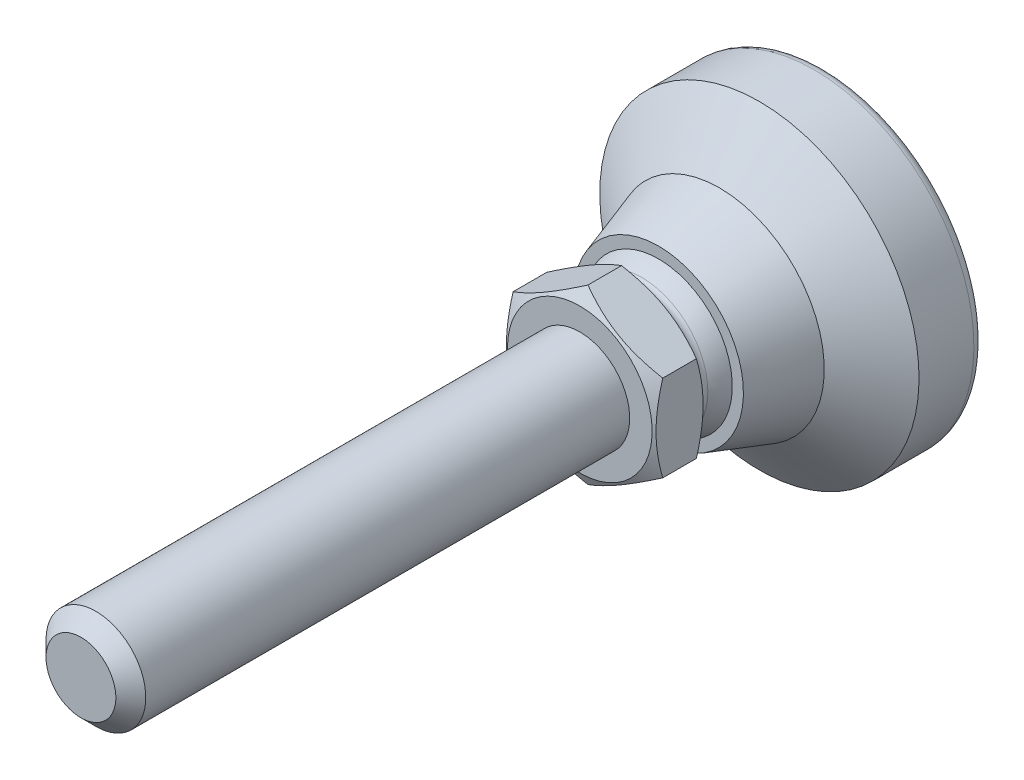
ISO-10303-21;
HEADER;
FILE_DESCRIPTION(('STEP AP214'),'2;1');
FILE_NAME('part.step','',(''),(''),'','','');
FILE_SCHEMA(('AUTOMOTIVE_DESIGN { 1 0 10303 214 1 1 1 1 }'));
ENDSEC;
DATA;
#1=APPLICATION_CONTEXT('core data for automotive mechanical design processes');
#2=APPLICATION_PROTOCOL_DEFINITION('international standard','automotive_design',2000,#1);
#3=PRODUCT_CONTEXT('',#1,'mechanical');
#4=PRODUCT('Part','Part','',(#3));
#5=PRODUCT_RELATED_PRODUCT_CATEGORY('part','',(#4));
#6=PRODUCT_DEFINITION_FORMATION('','',#4);
#7=PRODUCT_DEFINITION_CONTEXT('part definition',#1,'design');
#8=PRODUCT_DEFINITION('design','',#6,#7);
#9=PRODUCT_DEFINITION_SHAPE('','',#8);
#10=(LENGTH_UNIT() NAMED_UNIT(*) SI_UNIT(.MILLI.,.METRE.));
#11=(NAMED_UNIT(*) PLANE_ANGLE_UNIT() SI_UNIT($,.RADIAN.));
#12=(NAMED_UNIT(*) SI_UNIT($,.STERADIAN.) SOLID_ANGLE_UNIT());
#13=UNCERTAINTY_MEASURE_WITH_UNIT(LENGTH_MEASURE(1.E-05),#10,'distance_accuracy_value','');
#14=(GEOMETRIC_REPRESENTATION_CONTEXT(3) GLOBAL_UNCERTAINTY_ASSIGNED_CONTEXT((#13)) GLOBAL_UNIT_ASSIGNED_CONTEXT((#10,
#11,#12)) REPRESENTATION_CONTEXT('',''));
#15=CARTESIAN_POINT('',(0.,0.,0.));
#16=DIRECTION('',(0.,0.,1.));
#17=DIRECTION('',(1.,0.,0.));
#18=AXIS2_PLACEMENT_3D('',#15,#16,#17);
#19=CARTESIAN_POINT('',(0.,0.,18.7011230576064));
#20=DIRECTION('',(0.,0.,-1.));
#21=DIRECTION('',(0.,1.,0.));
#22=AXIS2_PLACEMENT_3D('',#19,#20,#21);
#23=TOROIDAL_SURFACE('',#22,7.30000010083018,0.799999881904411);
#24=CARTESIAN_POINT('',(0.,0.,19.5000000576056));
#25=DIRECTION('',(0.,0.,1.));
#26=DIRECTION('',(1.,0.,0.));
#27=AXIS2_PLACEMENT_3D('',#24,#25,#26);
#28=CIRCLE('',#27,7.25762853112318);
#29=CARTESIAN_POINT('',(7.25762853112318,0.,19.5000000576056));
#30=VERTEX_POINT('',#29);
#31=EDGE_CURVE('E264',#30,#30,#28,.F.);
#32=ORIENTED_EDGE('',*,*,#31,.T.);
#33=EDGE_LOOP('',(#32));
#34=FACE_BOUND('',#33,.T.);
#35=CARTESIAN_POINT('',(0.,0.,18.2846441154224));
#36=DIRECTION('',(0.,0.,-1.));
#37=DIRECTION('',(0.,1.,0.));
#38=AXIS2_PLACEMENT_3D('',#35,#36,#37);
#39=CIRCLE('',#38,6.61695903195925);
#40=CARTESIAN_POINT('',(-6.61695903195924,0.,18.2846441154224));
#41=VERTEX_POINT('',#40);
#42=EDGE_CURVE('E73',#41,#41,#39,.T.);
#43=ORIENTED_EDGE('',*,*,#42,.F.);
#44=EDGE_LOOP('',(#43));
#45=FACE_BOUND('',#44,.T.);
#46=ADVANCED_FACE('F14',(#34,#45),#23,.F.);
#47=CARTESIAN_POINT('',(0.,0.,14.249999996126));
#48=DIRECTION('',(0.,0.,-1.));
#49=DIRECTION('',(-1.,0.,0.));
#50=AXIS2_PLACEMENT_3D('',#47,#48,#49);
#51=SPHERICAL_SURFACE('',#50,7.75);
#52=CARTESIAN_POINT('',(0.,0.,16.6));
#53=DIRECTION('',(0.,0.,-1.));
#54=DIRECTION('',(0.,1.,0.));
#55=AXIS2_PLACEMENT_3D('',#52,#53,#54);
#56=CIRCLE('',#55,7.38512017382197);
#57=CARTESIAN_POINT('',(-7.38512017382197,0.,16.6));
#58=VERTEX_POINT('',#57);
#59=EDGE_CURVE('E120',#58,#58,#56,.T.);
#60=CARTESIAN_POINT('',(-7.38512017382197,0.,16.6));
#61=CARTESIAN_POINT('',(-7.37925798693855,0.,16.6184225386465));
#62=CARTESIAN_POINT('',(-7.37332686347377,0.,16.6368231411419));
#63=CARTESIAN_POINT('',(-7.36132708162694,0.,16.6735794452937));
#64=CARTESIAN_POINT('',(-7.3552584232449,0.,16.6919351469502));
#65=CARTESIAN_POINT('',(-7.34298390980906,0.,16.7286006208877));
#66=CARTESIAN_POINT('',(-7.33677805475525,0.,16.7469103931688));
#67=CARTESIAN_POINT('',(-7.32422949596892,0.,16.7834829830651));
#68=CARTESIAN_POINT('',(-7.3178867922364,0.,16.8017458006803));
#69=CARTESIAN_POINT('',(-7.30506489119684,0.,16.8382234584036));
#70=CARTESIAN_POINT('',(-7.29858569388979,0.,16.8564382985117));
#71=CARTESIAN_POINT('',(-7.28549116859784,0.,16.8928189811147));
#72=CARTESIAN_POINT('',(-7.27887584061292,0.,16.9109848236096));
#73=CARTESIAN_POINT('',(-7.26550942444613,0.,16.9472664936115));
#74=CARTESIAN_POINT('',(-7.25875833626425,0.,16.9653823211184));
#75=CARTESIAN_POINT('',(-7.24512077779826,0.,17.0015629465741));
#76=CARTESIAN_POINT('',(-7.23823430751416,0.,17.0196277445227));
#77=CARTESIAN_POINT('',(-7.22432637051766,0.,17.0557052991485));
#78=CARTESIAN_POINT('',(-7.21730490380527,0.,17.0737180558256));
#79=CARTESIAN_POINT('',(-7.2031273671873,0.,17.1096905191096));
#80=CARTESIAN_POINT('',(-7.19597129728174,0.,17.1276502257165));
#81=CARTESIAN_POINT('',(-7.18152495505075,0.,17.1635155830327));
#82=CARTESIAN_POINT('',(-7.17423468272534,0.,17.1814212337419));
#83=CARTESIAN_POINT('',(-7.159520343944,0.,17.2171774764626));
#84=CARTESIAN_POINT('',(-7.15209627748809,0.,17.235028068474));
#85=CARTESIAN_POINT('',(-7.13711476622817,0.,17.2706731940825));
#86=CARTESIAN_POINT('',(-7.12955732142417,0.,17.2884677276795));
#87=CARTESIAN_POINT('',(-7.11430947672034,0.,17.323999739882));
#88=CARTESIAN_POINT('',(-7.1066190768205,0.,17.3417372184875));
#89=CARTESIAN_POINT('',(-7.09110575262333,0.,17.3771541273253));
#90=CARTESIAN_POINT('',(-7.083282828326,0.,17.3948335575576));
#91=CARTESIAN_POINT('',(-7.06750489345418,0.,17.4301333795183));
#92=CARTESIAN_POINT('',(-7.05954988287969,0.,17.4477537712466));
#93=CARTESIAN_POINT('',(-7.04350822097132,0.,17.482934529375));
#94=CARTESIAN_POINT('',(-7.03542156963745,0.,17.5004948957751));
#95=CARTESIAN_POINT('',(-7.01911707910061,0.,17.5355546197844));
#96=CARTESIAN_POINT('',(-7.01089923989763,0.,17.5530539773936));
#97=CARTESIAN_POINT('',(-6.99433283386,0.,17.5879907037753));
#98=CARTESIAN_POINT('',(-6.98598426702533,0.,17.6054280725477));
#99=CARTESIAN_POINT('',(-6.96915687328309,0.,17.6402398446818));
#100=CARTESIAN_POINT('',(-6.96067804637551,0.,17.6576142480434));
#101=CARTESIAN_POINT('',(-6.94359060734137,0.,17.692299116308));
#102=CARTESIAN_POINT('',(-6.93498199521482,0.,17.7096095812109));
#103=CARTESIAN_POINT('',(-6.91763546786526,0.,17.7441656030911));
#104=CARTESIAN_POINT('',(-6.90889755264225,0.,17.7614111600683));
#105=CARTESIAN_POINT('',(-6.89129290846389,0.,17.7958364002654));
#106=CARTESIAN_POINT('',(-6.88242617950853,0.,17.8130160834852));
#107=CARTESIAN_POINT('',(-6.86456440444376,0.,17.8473086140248));
#108=CARTESIAN_POINT('',(-6.85556935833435,0.,17.8644214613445));
#109=CARTESIAN_POINT('',(-6.83745145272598,0.,17.8985793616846));
#110=CARTESIAN_POINT('',(-6.82832859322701,0.,17.9156244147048));
#111=CARTESIAN_POINT('',(-6.80995557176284,0.,17.9496457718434));
#112=CARTESIAN_POINT('',(-6.80070540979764,0.,17.9666220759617));
#113=CARTESIAN_POINT('',(-6.78207830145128,0.,18.0005049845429));
#114=CARTESIAN_POINT('',(-6.77270135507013,0.,18.0174115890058));
#115=CARTESIAN_POINT('',(-6.75382120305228,0.,18.0511541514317));
#116=CARTESIAN_POINT('',(-6.74431799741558,0.,18.0679901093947));
#117=CARTESIAN_POINT('',(-6.72518585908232,0.,18.1015904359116));
#118=CARTESIAN_POINT('',(-6.71555692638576,0.,18.1183548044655));
#119=CARTESIAN_POINT('',(-6.69617387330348,0.,18.1518110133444));
#120=CARTESIAN_POINT('',(-6.68641975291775,0.,18.1685028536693));
#121=CARTESIAN_POINT('',(-6.66678687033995,0.,18.2018130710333));
#122=CARTESIAN_POINT('',(-6.65690810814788,0.,18.2184314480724));
#123=CARTESIAN_POINT('',(-6.63702649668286,0.,18.2515938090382));
#124=CARTESIAN_POINT('',(-6.62702364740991,0.,18.2681377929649));
#125=CARTESIAN_POINT('',(-6.61695903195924,0.,18.2846441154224));
#126=B_SPLINE_CURVE_WITH_KNOTS('',3,(#60,#61,#62,#63,#64,#65,#66,#67,#68,#69,#70,#71,#72,#73,
#74,#75,#76,#77,#78,#79,#80,#81,#82,#83,#84,#85,#86,#87,#88,#89,#90,#91,#92,#93,#94,#95,#96,#97,
#98,#99,#100,#101,#102,#103,#104,#105,#106,#107,#108,#109,#110,#111,#112,#113,#114,#115,#116,
#117,#118,#119,#120,#121,#122,#123,#124,#125),.UNSPECIFIED.,.F.,.F.,(4,2,2,2,2,2,2,2,2,2,2,2,2,
2,2,2,2,2,2,2,2,2,2,2,2,2,2,2,2,2,2,2,4),(0.,0.0579981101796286,0.115996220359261,
0.173994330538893,0.231992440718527,0.289990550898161,0.347988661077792,0.405986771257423,
0.463984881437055,0.521982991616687,0.579981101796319,0.637979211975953,0.695977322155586,
0.753975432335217,0.811973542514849,0.86997165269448,0.927969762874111,0.985967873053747,
1.04396598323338,1.10196409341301,1.15996220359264,1.21796031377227,1.27595842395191,
1.33395653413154,1.39195464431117,1.4499527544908,1.50795086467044,1.56594897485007,
1.6239470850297,1.68194519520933,1.73994330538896,1.7979414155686,1.85593952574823),.UNSPECIFIED.);
#127=EDGE_CURVE('BSEAM241',#58,#41,#126,.T.);
#128=ORIENTED_EDGE('',*,*,#59,.F.);
#129=ORIENTED_EDGE('',*,*,#42,.T.);
#130=ORIENTED_EDGE('',*,*,#127,.T.);
#131=ORIENTED_EDGE('',*,*,#127,.F.);
#132=EDGE_LOOP('',(#128,#130,#129,#131));
#133=FACE_BOUND('',#132,.T.);
#134=ADVANCED_FACE('F241',(#133),#51,.T.);
#135=CARTESIAN_POINT('',(-7.38512017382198,0.,16.6));
#136=DIRECTION('',(0.,0.,-1.));
#137=DIRECTION('',(0.,1.,0.));
#138=AXIS2_PLACEMENT_3D('',#135,#136,#137);
#139=PLANE('',#138);
#140=CARTESIAN_POINT('',(0.,0.,16.6));
#141=DIRECTION('',(0.,0.,-1.));
#142=DIRECTION('',(0.,1.,0.));
#143=AXIS2_PLACEMENT_3D('',#140,#141,#142);
#144=CIRCLE('',#143,8.5);
#145=CARTESIAN_POINT('',(0.,8.5,16.6));
#146=VERTEX_POINT('',#145);
#147=EDGE_CURVE('E117',#146,#146,#144,.T.);
#148=ORIENTED_EDGE('',*,*,#147,.F.);
#149=EDGE_LOOP('',(#148));
#150=FACE_BOUND('',#149,.T.);
#151=ORIENTED_EDGE('',*,*,#59,.T.);
#152=EDGE_LOOP('',(#151));
#153=FACE_BOUND('',#152,.T.);
#154=ADVANCED_FACE('F247',(#150,#153),#139,.F.);
#155=CARTESIAN_POINT('',(0.,0.,16.6));
#156=DIRECTION('',(0.,0.,-1.));
#157=DIRECTION('',(0.,1.,0.));
#158=AXIS2_PLACEMENT_3D('',#155,#156,#157);
#159=CONICAL_SURFACE('',#158,8.5,0.316824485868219);
#160=CARTESIAN_POINT('',(0.,0.,10.5));
#161=DIRECTION('',(0.,0.,-1.));
#162=DIRECTION('',(0.,1.,0.));
#163=AXIS2_PLACEMENT_3D('',#160,#161,#162);
#164=CIRCLE('',#163,10.5);
#165=CARTESIAN_POINT('',(0.,10.5,10.5));
#166=VERTEX_POINT('',#165);
#167=EDGE_CURVE('E114',#166,#166,#164,.T.);
#168=ORIENTED_EDGE('',*,*,#167,.F.);
#169=EDGE_LOOP('',(#168));
#170=FACE_BOUND('',#169,.T.);
#171=ORIENTED_EDGE('',*,*,#147,.T.);
#172=EDGE_LOOP('',(#171));
#173=FACE_BOUND('',#172,.T.);
#174=ADVANCED_FACE('F290',(#170,#173),#159,.T.);
#175=CARTESIAN_POINT('',(0.,0.,10.5));
#176=DIRECTION('',(0.,0.,-1.));
#177=DIRECTION('',(0.,1.,0.));
#178=AXIS2_PLACEMENT_3D('',#175,#176,#177);
#179=CONICAL_SURFACE('',#178,10.5,0.942000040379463);
#180=CARTESIAN_POINT('',(0.,0.,6.5));
#181=DIRECTION('',(0.,0.,-1.));
#182=DIRECTION('',(0.,1.,0.));
#183=AXIS2_PLACEMENT_3D('',#180,#181,#182);
#184=CIRCLE('',#183,16.);
#185=CARTESIAN_POINT('',(0.,16.,6.5));
#186=VERTEX_POINT('',#185);
#187=EDGE_CURVE('E111',#186,#186,#184,.T.);
#188=ORIENTED_EDGE('',*,*,#187,.F.);
#189=EDGE_LOOP('',(#188));
#190=FACE_BOUND('',#189,.T.);
#191=ORIENTED_EDGE('',*,*,#167,.T.);
#192=EDGE_LOOP('',(#191));
#193=FACE_BOUND('',#192,.T.);
#194=ADVANCED_FACE('F286',(#190,#193),#179,.T.);
#195=CARTESIAN_POINT('',(0.,0.,0.));
#196=DIRECTION('',(0.,0.,-1.));
#197=DIRECTION('',(0.,1.,0.));
#198=AXIS2_PLACEMENT_3D('',#195,#196,#197);
#199=CYLINDRICAL_SURFACE('',#198,16.);
#200=CARTESIAN_POINT('',(0.,0.,1.));
#201=DIRECTION('',(0.,0.,-1.));
#202=DIRECTION('',(0.,1.,0.));
#203=AXIS2_PLACEMENT_3D('',#200,#201,#202);
#204=CIRCLE('',#203,16.);
#205=CARTESIAN_POINT('',(0.,16.,1.));
#206=VERTEX_POINT('',#205);
#207=EDGE_CURVE('E88',#206,#206,#204,.T.);
#208=ORIENTED_EDGE('',*,*,#207,.F.);
#209=EDGE_LOOP('',(#208));
#210=FACE_BOUND('',#209,.T.);
#211=ORIENTED_EDGE('',*,*,#187,.T.);
#212=EDGE_LOOP('',(#211));
#213=FACE_BOUND('',#212,.T.);
#214=ADVANCED_FACE('F280',(#210,#213),#199,.T.);
#215=CARTESIAN_POINT('',(0.,0.,1.));
#216=DIRECTION('',(0.,0.,-1.));
#217=DIRECTION('',(0.,1.,0.));
#218=AXIS2_PLACEMENT_3D('',#215,#216,#217);
#219=TOROIDAL_SURFACE('',#218,15.,1.);
#220=CARTESIAN_POINT('',(0.,0.,0.));
#221=DIRECTION('',(0.,0.,-1.));
#222=DIRECTION('',(0.,1.,0.));
#223=AXIS2_PLACEMENT_3D('',#220,#221,#222);
#224=CIRCLE('',#223,15.);
#225=CARTESIAN_POINT('',(0.,15.,0.));
#226=VERTEX_POINT('',#225);
#227=EDGE_CURVE('E85',#226,#226,#224,.T.);
#228=ORIENTED_EDGE('',*,*,#227,.F.);
#229=EDGE_LOOP('',(#228));
#230=FACE_BOUND('',#229,.T.);
#231=ORIENTED_EDGE('',*,*,#207,.T.);
#232=EDGE_LOOP('',(#231));
#233=FACE_BOUND('',#232,.T.);
#234=ADVANCED_FACE('F273',(#230,#233),#219,.T.);
#235=CARTESIAN_POINT('',(-15.,0.,0.));
#236=DIRECTION('',(0.,0.,1.));
#237=DIRECTION('',(0.,-1.,0.));
#238=AXIS2_PLACEMENT_3D('',#235,#236,#237);
#239=PLANE('',#238);
#240=ORIENTED_EDGE('',*,*,#227,.T.);
#241=EDGE_LOOP('',(#240));
#242=FACE_BOUND('',#241,.T.);
#243=ADVANCED_FACE('F268',(#242),#239,.F.);
#244=CARTESIAN_POINT('',(0.,7.25,19.5000000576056));
#245=DIRECTION('',(0.,0.,-1.));
#246=DIRECTION('',(-1.,0.,0.));
#247=AXIS2_PLACEMENT_3D('',#244,#245,#246);
#248=PLANE('',#247);
#249=CARTESIAN_POINT('',(0.,0.,19.5000000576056));
#250=DIRECTION('',(0.,0.,-1.));
#251=DIRECTION('',(-1.,0.,0.));
#252=AXIS2_PLACEMENT_3D('',#249,#250,#251);
#253=CIRCLE('',#252,7.25);
#254=CARTESIAN_POINT('',(-7.25,0.,19.5000000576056));
#255=VERTEX_POINT('',#254);
#256=EDGE_CURVE('E79',#255,#255,#253,.T.);
#257=ORIENTED_EDGE('',*,*,#256,.T.);
#258=EDGE_LOOP('',(#257));
#259=FACE_BOUND('',#258,.T.);
#260=ORIENTED_EDGE('',*,*,#31,.F.);
#261=EDGE_LOOP('',(#260));
#262=FACE_BOUND('',#261,.T.);
#263=ADVANCED_FACE('F139',(#259,#262),#248,.F.);
#264=CARTESIAN_POINT('',(0.,0.,21.3134150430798));
#265=DIRECTION('',(0.,0.,1.));
#266=DIRECTION('',(1.,0.,0.));
#267=AXIS2_PLACEMENT_3D('',#264,#265,#266);
#268=CONICAL_SURFACE('',#267,10.3909268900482,1.0471975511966);
#269=CARTESIAN_POINT('',(-7.5002,4.33001154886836,20.3142772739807));
#270=CARTESIAN_POINT('',(-7.3353416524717,4.42519256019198,20.2593328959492));
#271=CARTESIAN_POINT('',(-7.16986863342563,4.52072845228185,20.2068821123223));
#272=CARTESIAN_POINT('',(-6.83757877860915,4.71257608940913,20.1076545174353));
#273=CARTESIAN_POINT('',(-6.67076139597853,4.80888815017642,20.0608801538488));
#274=CARTESIAN_POINT('',(-6.16763831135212,5.09936639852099,19.9299898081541));
#275=CARTESIAN_POINT('',(-5.82934661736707,5.29467919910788,19.8555409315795));
#276=CARTESIAN_POINT('',(-5.32309925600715,5.58696124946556,19.7682409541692));
#277=CARTESIAN_POINT('',(-5.15665618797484,5.68305719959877,19.7433717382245));
#278=CARTESIAN_POINT('',(-4.82301799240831,5.87568330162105,19.701669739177));
#279=CARTESIAN_POINT('',(-4.65582293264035,5.97221341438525,19.6848362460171));
#280=CARTESIAN_POINT('',(-4.32114243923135,6.16544128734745,19.6596346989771));
#281=CARTESIAN_POINT('',(-4.15365755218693,6.26213873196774,19.6512570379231));
#282=CARTESIAN_POINT('',(-3.81854232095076,6.45561760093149,19.6431378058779));
#283=CARTESIAN_POINT('',(-3.65091198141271,6.55239902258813,19.6433959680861));
#284=CARTESIAN_POINT('',(-3.19166219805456,6.81754700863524,19.6559736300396));
#285=CARTESIAN_POINT('',(-2.90019309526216,6.98582677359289,19.6770872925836));
#286=CARTESIAN_POINT('',(-2.31919079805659,7.32126860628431,19.7440382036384));
#287=CARTESIAN_POINT('',(-2.02965964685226,7.48842949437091,19.7898983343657));
#288=CARTESIAN_POINT('',(-1.44748813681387,7.82454637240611,19.9045350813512));
#289=CARTESIAN_POINT('',(-1.15492123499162,7.99345995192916,19.9737973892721));
#290=CARTESIAN_POINT('',(-0.574150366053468,8.3287681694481,20.1309947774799));
#291=CARTESIAN_POINT('',(-0.285938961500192,8.49516710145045,20.2188929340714));
#292=CARTESIAN_POINT('',(0.00020000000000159,8.66036950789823,20.3142772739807));
#293=B_SPLINE_CURVE_WITH_KNOTS('',3,(#269,#270,#271,#272,#273,#274,#275,#276,#277,#278,#279,
#280,#281,#282,#283,#284,#285,#286,#287,#288,#289,#290,#291,#292),.UNSPECIFIED.,.F.,.F.,(4,2,2,
2,2,2,2,2,2,2,2,4),(0.,0.594350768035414,1.1889569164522,2.38063993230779,2.96188692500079,
3.54308254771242,4.12361709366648,4.70413370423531,5.71473675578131,6.72627588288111,
7.76024925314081,8.7921928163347),.UNSPECIFIED.);
#294=CARTESIAN_POINT('',(-7.5,4.3301270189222,20.3142106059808));
#295=VERTEX_POINT('',#294);
#296=CARTESIAN_POINT('',(0.,8.66025403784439,20.3142106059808));
#297=VERTEX_POINT('',#296);
#298=EDGE_CURVE('E29',#295,#297,#293,.T.);
#299=ORIENTED_EDGE('',*,*,#298,.T.);
#300=CARTESIAN_POINT('',(-0.000199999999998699,8.66036950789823,20.3142772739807));
#301=CARTESIAN_POINT('',(0.164658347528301,8.56518849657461,20.2593328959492));
#302=CARTESIAN_POINT('',(0.33013136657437,8.46965260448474,20.2068821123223));
#303=CARTESIAN_POINT('',(0.662421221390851,8.27780496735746,20.1076545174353));
#304=CARTESIAN_POINT('',(0.829238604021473,8.18149290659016,20.0608801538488));
#305=CARTESIAN_POINT('',(1.33236168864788,7.89101465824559,19.9299898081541));
#306=CARTESIAN_POINT('',(1.67065338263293,7.69570185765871,19.8555409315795));
#307=CARTESIAN_POINT('',(2.17690074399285,7.40341980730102,19.7682409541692));
#308=CARTESIAN_POINT('',(2.34334381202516,7.30732385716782,19.7433717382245));
#309=CARTESIAN_POINT('',(2.67698200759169,7.11469775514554,19.701669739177));
#310=CARTESIAN_POINT('',(2.84417706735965,7.01816764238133,19.6848362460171));
#311=CARTESIAN_POINT('',(3.17885756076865,6.82493976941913,19.6596346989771));
#312=CARTESIAN_POINT('',(3.34634244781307,6.72824232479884,19.6512570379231));
#313=CARTESIAN_POINT('',(3.68145767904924,6.53476345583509,19.6431378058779));
#314=CARTESIAN_POINT('',(3.8490880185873,6.43798203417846,19.6433959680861));
#315=CARTESIAN_POINT('',(4.30833780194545,6.17283404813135,19.6559736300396));
#316=CARTESIAN_POINT('',(4.59980690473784,6.0045542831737,19.6770872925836));
#317=CARTESIAN_POINT('',(5.18080920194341,5.66911245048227,19.7440382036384));
#318=CARTESIAN_POINT('',(5.47034035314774,5.50195156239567,19.7898983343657));
#319=CARTESIAN_POINT('',(6.05251186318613,5.16583468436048,19.9045350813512));
#320=CARTESIAN_POINT('',(6.34507876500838,4.99692110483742,19.9737973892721));
#321=CARTESIAN_POINT('',(6.92584963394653,4.66161288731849,20.1309947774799));
#322=CARTESIAN_POINT('',(7.21406103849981,4.49521395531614,20.2188929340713));
#323=CARTESIAN_POINT('',(7.5002,4.33001154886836,20.3142772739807));
#324=B_SPLINE_CURVE_WITH_KNOTS('',3,(#300,#301,#302,#303,#304,#305,#306,#307,#308,#309,#310,
#311,#312,#313,#314,#315,#316,#317,#318,#319,#320,#321,#322,#323),.UNSPECIFIED.,.F.,.F.,(4,2,2,
2,2,2,2,2,2,2,2,4),(0.,0.594350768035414,1.1889569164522,2.3806399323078,2.96188692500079,
3.54308254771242,4.12361709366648,4.70413370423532,5.71473675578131,6.72627588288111,
7.76024925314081,8.7921928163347),.UNSPECIFIED.);
#325=CARTESIAN_POINT('',(7.5,4.3301270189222,20.3142106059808));
#326=VERTEX_POINT('',#325);
#327=EDGE_CURVE('E66',#297,#326,#324,.T.);
#328=ORIENTED_EDGE('',*,*,#327,.T.);
#329=CARTESIAN_POINT('',(7.5,-11.6031313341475,23.2908986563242));
#330=CARTESIAN_POINT('',(7.5,-11.2757912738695,23.1322226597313));
#331=CARTESIAN_POINT('',(7.5,-10.9476967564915,22.9750762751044));
#332=CARTESIAN_POINT('',(7.5,-10.2895974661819,22.6647035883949));
#333=CARTESIAN_POINT('',(7.5,-9.95959239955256,22.5114779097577));
#334=CARTESIAN_POINT('',(7.5,-9.29555686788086,22.2090306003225));
#335=CARTESIAN_POINT('',(7.5,-8.96151425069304,22.0598355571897));
#336=CARTESIAN_POINT('',(7.5,-8.2907623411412,21.7675887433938));
#337=CARTESIAN_POINT('',(7.5,-7.95405317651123,21.6245366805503));
#338=CARTESIAN_POINT('',(7.5,-7.26667404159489,21.3417730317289));
#339=CARTESIAN_POINT('',(7.5,-6.91590042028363,21.2023120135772));
#340=CARTESIAN_POINT('',(7.5,-6.2102398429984,20.9340131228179));
#341=CARTESIAN_POINT('',(7.5,-5.85535242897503,20.8051764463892));
#342=CARTESIAN_POINT('',(7.5,-5.1415687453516,20.5615294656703));
#343=CARTESIAN_POINT('',(7.5,-4.78268235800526,20.4466905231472));
#344=CARTESIAN_POINT('',(7.5,-4.05977470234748,20.234740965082));
#345=CARTESIAN_POINT('',(7.5,-3.69575509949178,20.1376247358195));
#346=CARTESIAN_POINT('',(7.5,-2.96432817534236,19.9663211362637));
#347=CARTESIAN_POINT('',(7.5,-2.59695052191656,19.8920105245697));
#348=CARTESIAN_POINT('',(7.5,-2.04256118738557,19.8008801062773));
#349=CARTESIAN_POINT('',(7.5,-1.85719710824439,19.7738913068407));
#350=CARTESIAN_POINT('',(7.5,-1.4855571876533,19.7272222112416));
#351=CARTESIAN_POINT('',(7.5,-1.29928143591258,19.7075412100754));
#352=CARTESIAN_POINT('',(7.5,-0.928488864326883,19.6761251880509));
#353=CARTESIAN_POINT('',(7.5,-0.743980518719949,19.6642905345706));
#354=CARTESIAN_POINT('',(7.5,-0.374628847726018,19.6484323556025));
#355=CARTESIAN_POINT('',(7.5,-0.189785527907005,19.64440870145));
#356=CARTESIAN_POINT('',(7.5,0.179906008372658,19.6442684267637));
#357=CARTESIAN_POINT('',(7.5,0.364754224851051,19.6481518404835));
#358=CARTESIAN_POINT('',(7.5,0.734123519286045,19.6637312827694));
#359=CARTESIAN_POINT('',(7.5,0.918644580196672,19.6754277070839));
#360=CARTESIAN_POINT('',(7.5,1.36296023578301,19.7127523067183));
#361=CARTESIAN_POINT('',(7.5,1.62244599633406,19.7421349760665));
#362=CARTESIAN_POINT('',(7.5,2.13946089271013,19.8147415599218));
#363=CARTESIAN_POINT('',(7.5,2.39698975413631,19.857967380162));
#364=CARTESIAN_POINT('',(7.5,3.16636380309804,20.0061148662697));
#365=CARTESIAN_POINT('',(7.5,3.67470311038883,20.1294786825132));
#366=CARTESIAN_POINT('',(7.5,4.43476912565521,20.3430177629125));
#367=CARTESIAN_POINT('',(7.5,4.6904479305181,20.419931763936));
#368=CARTESIAN_POINT('',(7.5,5.19932153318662,20.58165257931));
#369=CARTESIAN_POINT('',(7.5,5.4525163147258,20.6664594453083));
#370=CARTESIAN_POINT('',(7.5,5.9565033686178,20.8426132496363));
#371=CARTESIAN_POINT('',(7.5,6.20729642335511,20.9339579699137));
#372=CARTESIAN_POINT('',(7.5,6.70681108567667,21.122122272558));
#373=CARTESIAN_POINT('',(7.5,6.95553271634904,21.2189417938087));
#374=CARTESIAN_POINT('',(7.5,7.53771967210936,21.4517718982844));
#375=CARTESIAN_POINT('',(7.5,7.87043383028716,21.5896571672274));
#376=CARTESIAN_POINT('',(7.5,8.53307427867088,21.8719901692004));
#377=CARTESIAN_POINT('',(7.5,8.86300040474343,22.0164382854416));
#378=CARTESIAN_POINT('',(7.5,9.52057128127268,22.3105924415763));
#379=CARTESIAN_POINT('',(7.5,9.84821557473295,22.4602995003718));
#380=CARTESIAN_POINT('',(7.5,10.5015480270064,22.7639302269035));
#381=CARTESIAN_POINT('',(7.5,10.8272361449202,22.9178539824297));
#382=CARTESIAN_POINT('',(7.5,11.4773047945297,23.2292929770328));
#383=CARTESIAN_POINT('',(7.5,11.8016836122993,23.3868117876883));
#384=CARTESIAN_POINT('',(7.5,12.4490521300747,23.7046810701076));
#385=CARTESIAN_POINT('',(7.5,12.7720418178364,23.8650315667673));
#386=CARTESIAN_POINT('',(7.5,13.7391730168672,24.3495428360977));
#387=CARTESIAN_POINT('',(7.5,14.3815607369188,24.6772039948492));
#388=CARTESIAN_POINT('',(7.5,15.6099638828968,25.3117519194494));
#389=CARTESIAN_POINT('',(7.5,16.1962499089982,25.6181171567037));
#390=CARTESIAN_POINT('',(7.5,17.3666390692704,26.2350342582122));
#391=CARTESIAN_POINT('',(7.5,17.9507421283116,26.5455862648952));
#392=CARTESIAN_POINT('',(7.5,19.1158224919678,27.1691239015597));
#393=CARTESIAN_POINT('',(7.5,19.696803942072,27.4821017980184));
#394=CARTESIAN_POINT('',(7.5,20.8573684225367,28.1105664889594));
#395=CARTESIAN_POINT('',(7.5,21.4369515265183,28.4260531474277));
#396=CARTESIAN_POINT('',(7.5,22.0160186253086,28.7424777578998));
#397=B_SPLINE_CURVE_WITH_KNOTS('',3,(#329,#330,#331,#332,#333,#334,#335,#336,#337,#338,#339,
#340,#341,#342,#343,#344,#345,#346,#347,#348,#349,#350,#351,#352,#353,#354,#355,#356,#357,#358,
#359,#360,#361,#362,#363,#364,#365,#366,#367,#368,#369,#370,#371,#372,#373,#374,#375,#376,#377,
#378,#379,#380,#381,#382,#383,#384,#385,#386,#387,#388,#389,#390,#391,#392,#393,#394,#395,#396),
.UNSPECIFIED.,.F.,.F.,(4,2,2,2,2,2,2,2,2,2,2,2,2,2,2,2,2,2,2,2,2,2,2,2,2,2,2,2,2,2,2,2,2,4),(0.,
1.09132747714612,2.18282742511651,3.28031725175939,4.37775482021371,5.51006272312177,
6.64249793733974,7.77257594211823,8.90229536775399,10.0257976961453,10.5876319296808,
11.14941194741,11.7039144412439,12.2584078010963,12.8129035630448,13.3674274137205,
14.1504164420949,14.933513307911,16.5005870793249,17.3015125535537,18.1024432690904,
18.9031035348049,19.7037548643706,20.7841230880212,21.8645544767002,22.9451963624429,
24.025860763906,25.1076500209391,26.1894487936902,28.3527662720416,30.3372679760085,
32.3218373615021,34.301591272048,36.2812385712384),.UNSPECIFIED.);
#398=CARTESIAN_POINT('',(7.5,-4.3301270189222,20.3142106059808));
#399=VERTEX_POINT('',#398);
#400=EDGE_CURVE('E69',#326,#399,#397,.F.);
#401=ORIENTED_EDGE('',*,*,#400,.T.);
#402=CARTESIAN_POINT('',(7.5002,-4.33001154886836,20.3142772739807));
#403=CARTESIAN_POINT('',(7.3353416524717,-4.42519256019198,20.2593328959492));
#404=CARTESIAN_POINT('',(7.16986863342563,-4.52072845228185,20.2068821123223));
#405=CARTESIAN_POINT('',(6.83757877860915,-4.71257608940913,20.1076545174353));
#406=CARTESIAN_POINT('',(6.67076139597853,-4.80888815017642,20.0608801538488));
#407=CARTESIAN_POINT('',(6.16763831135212,-5.09936639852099,19.9299898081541));
#408=CARTESIAN_POINT('',(5.82934661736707,-5.29467919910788,19.8555409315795));
#409=CARTESIAN_POINT('',(5.32309925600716,-5.58696124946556,19.7682409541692));
#410=CARTESIAN_POINT('',(5.15665618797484,-5.68305719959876,19.7433717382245));
#411=CARTESIAN_POINT('',(4.82301799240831,-5.87568330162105,19.701669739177));
#412=CARTESIAN_POINT('',(4.65582293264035,-5.97221341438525,19.6848362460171));
#413=CARTESIAN_POINT('',(4.32114243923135,-6.16544128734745,19.6596346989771));
#414=CARTESIAN_POINT('',(4.15365755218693,-6.26213873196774,19.6512570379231));
#415=CARTESIAN_POINT('',(3.81854232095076,-6.45561760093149,19.6431378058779));
#416=CARTESIAN_POINT('',(3.65091198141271,-6.55239902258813,19.6433959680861));
#417=CARTESIAN_POINT('',(3.19166219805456,-6.81754700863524,19.6559736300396));
#418=CARTESIAN_POINT('',(2.90019309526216,-6.98582677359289,19.6770872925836));
#419=CARTESIAN_POINT('',(2.31919079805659,-7.32126860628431,19.7440382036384));
#420=CARTESIAN_POINT('',(2.02965964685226,-7.48842949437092,19.7898983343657));
#421=CARTESIAN_POINT('',(1.44748813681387,-7.82454637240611,19.9045350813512));
#422=CARTESIAN_POINT('',(1.15492123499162,-7.99345995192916,19.9737973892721));
#423=CARTESIAN_POINT('',(0.574150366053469,-8.3287681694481,20.1309947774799));
#424=CARTESIAN_POINT('',(0.285938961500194,-8.49516710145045,20.2188929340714));
#425=CARTESIAN_POINT('',(-0.000200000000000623,-8.66036950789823,20.3142772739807));
#426=B_SPLINE_CURVE_WITH_KNOTS('',3,(#402,#403,#404,#405,#406,#407,#408,#409,#410,#411,#412,
#413,#414,#415,#416,#417,#418,#419,#420,#421,#422,#423,#424,#425),.UNSPECIFIED.,.F.,.F.,(4,2,2,
2,2,2,2,2,2,2,2,4),(0.,0.594350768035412,1.1889569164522,2.38063993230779,2.96188692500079,
3.54308254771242,4.12361709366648,4.70413370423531,5.71473675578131,6.72627588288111,
7.76024925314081,8.7921928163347),.UNSPECIFIED.);
#427=CARTESIAN_POINT('',(0.,-8.66025403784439,20.3142106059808));
#428=VERTEX_POINT('',#427);
#429=EDGE_CURVE('E78',#399,#428,#426,.T.);
#430=ORIENTED_EDGE('',*,*,#429,.T.);
#431=CARTESIAN_POINT('',(0.0002,-8.66036950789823,20.3142772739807));
#432=CARTESIAN_POINT('',(-0.164658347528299,-8.56518849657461,20.2593328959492));
#433=CARTESIAN_POINT('',(-0.330131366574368,-8.46965260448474,20.2068821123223));
#434=CARTESIAN_POINT('',(-0.662421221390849,-8.27780496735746,20.1076545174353));
#435=CARTESIAN_POINT('',(-0.829238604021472,-8.18149290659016,20.0608801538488));
#436=CARTESIAN_POINT('',(-1.33236168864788,-7.89101465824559,19.9299898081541));
#437=CARTESIAN_POINT('',(-1.67065338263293,-7.69570185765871,19.8555409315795));
#438=CARTESIAN_POINT('',(-2.17690074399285,-7.40341980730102,19.7682409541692));
#439=CARTESIAN_POINT('',(-2.34334381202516,-7.30732385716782,19.7433717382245));
#440=CARTESIAN_POINT('',(-2.67698200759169,-7.11469775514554,19.701669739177));
#441=CARTESIAN_POINT('',(-2.84417706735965,-7.01816764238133,19.6848362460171));
#442=CARTESIAN_POINT('',(-3.17885756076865,-6.82493976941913,19.6596346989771));
#443=CARTESIAN_POINT('',(-3.34634244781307,-6.72824232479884,19.6512570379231));
#444=CARTESIAN_POINT('',(-3.68145767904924,-6.53476345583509,19.6431378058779));
#445=CARTESIAN_POINT('',(-3.84908801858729,-6.43798203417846,19.6433959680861));
#446=CARTESIAN_POINT('',(-4.30833780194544,-6.17283404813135,19.6559736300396));
#447=CARTESIAN_POINT('',(-4.59980690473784,-6.0045542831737,19.6770872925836));
#448=CARTESIAN_POINT('',(-5.18080920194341,-5.66911245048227,19.7440382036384));
#449=CARTESIAN_POINT('',(-5.47034035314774,-5.50195156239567,19.7898983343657));
#450=CARTESIAN_POINT('',(-6.05251186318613,-5.16583468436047,19.9045350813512));
#451=CARTESIAN_POINT('',(-6.34507876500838,-4.99692110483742,19.9737973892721));
#452=CARTESIAN_POINT('',(-6.92584963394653,-4.66161288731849,20.1309947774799));
#453=CARTESIAN_POINT('',(-7.21406103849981,-4.49521395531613,20.2188929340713));
#454=CARTESIAN_POINT('',(-7.5002,-4.33001154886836,20.3142772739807));
#455=B_SPLINE_CURVE_WITH_KNOTS('',3,(#431,#432,#433,#434,#435,#436,#437,#438,#439,#440,#441,
#442,#443,#444,#445,#446,#447,#448,#449,#450,#451,#452,#453,#454),.UNSPECIFIED.,.F.,.F.,(4,2,2,
2,2,2,2,2,2,2,2,4),(0.,0.594350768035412,1.1889569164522,2.38063993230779,2.96188692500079,
3.54308254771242,4.12361709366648,4.70413370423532,5.71473675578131,6.72627588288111,
7.76024925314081,8.7921928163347),.UNSPECIFIED.);
#456=CARTESIAN_POINT('',(-7.5,-4.3301270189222,20.3142106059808));
#457=VERTEX_POINT('',#456);
#458=EDGE_CURVE('E161',#428,#457,#455,.T.);
#459=ORIENTED_EDGE('',*,*,#458,.T.);
#460=CARTESIAN_POINT('',(-7.5,-11.6031313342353,23.2908986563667));
#461=CARTESIAN_POINT('',(-7.5,-11.2757912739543,23.132222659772));
#462=CARTESIAN_POINT('',(-7.5,-10.9476967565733,22.9750762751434));
#463=CARTESIAN_POINT('',(-7.5,-10.2895974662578,22.6647035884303));
#464=CARTESIAN_POINT('',(-7.5,-9.95959239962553,22.5114779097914));
#465=CARTESIAN_POINT('',(-7.5,-9.29555686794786,22.2090306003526));
#466=CARTESIAN_POINT('',(-7.5,-8.96151425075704,22.059835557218));
#467=CARTESIAN_POINT('',(-7.5,-8.29076234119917,21.7675887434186));
#468=CARTESIAN_POINT('',(-7.5,-7.95405317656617,21.6245366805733));
#469=CARTESIAN_POINT('',(-7.5,-7.26667404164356,21.3417730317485));
#470=CARTESIAN_POINT('',(-7.5,-6.91590042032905,21.202312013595));
#471=CARTESIAN_POINT('',(-7.5,-6.21023984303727,20.9340131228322));
#472=CARTESIAN_POINT('',(-7.5,-5.8553524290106,20.8051764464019));
#473=CARTESIAN_POINT('',(-7.5,-5.14156874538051,20.5615294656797));
#474=CARTESIAN_POINT('',(-7.5,-4.78268235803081,20.4466905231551));
#475=CARTESIAN_POINT('',(-7.5,-4.05977470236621,20.2347409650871));
#476=CARTESIAN_POINT('',(-7.5,-3.69575509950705,20.1376247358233));
#477=CARTESIAN_POINT('',(-7.5,-2.96432817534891,19.966321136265));
#478=CARTESIAN_POINT('',(-7.5,-2.59695052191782,19.8920105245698));
#479=CARTESIAN_POINT('',(-7.5,-2.04256118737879,19.8008801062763));
#480=CARTESIAN_POINT('',(-7.5,-1.85719710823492,19.7738913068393));
#481=CARTESIAN_POINT('',(-7.5,-1.48555718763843,19.7272222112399));
#482=CARTESIAN_POINT('',(-7.5,-1.299281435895,19.7075412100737));
#483=CARTESIAN_POINT('',(-7.5,-0.928488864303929,19.6761251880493));
#484=CARTESIAN_POINT('',(-7.5,-0.743980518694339,19.6642905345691));
#485=CARTESIAN_POINT('',(-7.5,-0.374628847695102,19.6484323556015));
#486=CARTESIAN_POINT('',(-7.5,-0.189785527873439,19.6444087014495));
#487=CARTESIAN_POINT('',(-7.5,0.179906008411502,19.6442684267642));
#488=CARTESIAN_POINT('',(-7.5,0.364754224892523,19.6481518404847));
#489=CARTESIAN_POINT('',(-7.5,0.734123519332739,19.663731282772));
#490=CARTESIAN_POINT('',(-7.5,0.918644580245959,19.6754277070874));
#491=CARTESIAN_POINT('',(-7.5,1.36296023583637,19.7127523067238));
#492=CARTESIAN_POINT('',(-7.5,1.62244599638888,19.7421349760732));
#493=CARTESIAN_POINT('',(-7.5,2.13946089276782,19.814741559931));
#494=CARTESIAN_POINT('',(-7.5,2.3969897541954,19.8579673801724));
#495=CARTESIAN_POINT('',(-7.5,3.16636380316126,20.0061148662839));
#496=CARTESIAN_POINT('',(-7.5,3.6747031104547,20.1294786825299));
#497=CARTESIAN_POINT('',(-7.5,4.43476912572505,20.343017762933));
#498=CARTESIAN_POINT('',(-7.5,4.69044793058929,20.4199317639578));
#499=CARTESIAN_POINT('',(-7.5,5.19932153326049,20.5816525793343));
#500=CARTESIAN_POINT('',(-7.5,5.45251631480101,20.6664594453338));
#501=CARTESIAN_POINT('',(-7.5,5.95650336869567,20.8426132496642));
#502=CARTESIAN_POINT('',(-7.5,6.2072964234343,20.9339579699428));
#503=CARTESIAN_POINT('',(-7.5,6.70681108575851,21.1221222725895));
#504=CARTESIAN_POINT('',(-7.5,6.9555327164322,21.2189417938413));
#505=CARTESIAN_POINT('',(-7.5,7.53771967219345,21.4517718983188));
#506=CARTESIAN_POINT('',(-7.5,7.87043383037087,21.5896571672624));
#507=CARTESIAN_POINT('',(-7.5,8.53307427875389,21.8719901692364));
#508=CARTESIAN_POINT('',(-7.5,8.8630004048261,22.016438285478));
#509=CARTESIAN_POINT('',(-7.5,9.52057128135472,22.3105924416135));
#510=CARTESIAN_POINT('',(-7.5,9.84821557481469,22.4602995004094));
#511=CARTESIAN_POINT('',(-7.5,10.5015480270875,22.7639302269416));
#512=CARTESIAN_POINT('',(-7.5,10.8272361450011,22.9178539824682));
#513=CARTESIAN_POINT('',(-7.5,11.4773047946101,23.2292929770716));
#514=CARTESIAN_POINT('',(-7.5,11.8016836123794,23.3868117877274));
#515=CARTESIAN_POINT('',(-7.5,12.4490521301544,23.704681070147));
#516=CARTESIAN_POINT('',(-7.5,12.7720418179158,23.8650315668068));
#517=CARTESIAN_POINT('',(-7.5,13.7391730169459,24.3495428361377));
#518=CARTESIAN_POINT('',(-7.5,14.3815607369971,24.6772039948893));
#519=CARTESIAN_POINT('',(-7.5,15.6099638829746,25.31175191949));
#520=CARTESIAN_POINT('',(-7.5,16.196249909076,25.6181171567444));
#521=CARTESIAN_POINT('',(-7.5,17.3666390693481,26.2350342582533));
#522=CARTESIAN_POINT('',(-7.5,17.9507421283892,26.5455862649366));
#523=CARTESIAN_POINT('',(-7.5,19.1158224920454,27.1691239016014));
#524=CARTESIAN_POINT('',(-7.5,19.6968039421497,27.4821017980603));
#525=CARTESIAN_POINT('',(-7.5,20.8573684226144,28.1105664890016));
#526=CARTESIAN_POINT('',(-7.5,21.4369515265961,28.4260531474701));
#527=CARTESIAN_POINT('',(-7.5,22.0160186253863,28.7424777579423));
#528=B_SPLINE_CURVE_WITH_KNOTS('',3,(#460,#461,#462,#463,#464,#465,#466,#467,#468,#469,#470,
#471,#472,#473,#474,#475,#476,#477,#478,#479,#480,#481,#482,#483,#484,#485,#486,#487,#488,#489,
#490,#491,#492,#493,#494,#495,#496,#497,#498,#499,#500,#501,#502,#503,#504,#505,#506,#507,#508,
#509,#510,#511,#512,#513,#514,#515,#516,#517,#518,#519,#520,#521,#522,#523,#524,#525,#526,#527),
.UNSPECIFIED.,.F.,.F.,(4,2,2,2,2,2,2,2,2,2,2,2,2,2,2,2,2,2,2,2,2,2,2,2,2,2,2,2,2,2,2,2,2,4),(0.,
1.0913274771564,2.18282742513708,3.28031725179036,4.37775482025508,5.51006272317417,
6.64249793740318,7.77257594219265,8.90229536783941,10.0257976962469,10.5876319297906,
11.1494119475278,11.7039144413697,12.25840780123,12.8129035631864,13.36742741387,
14.1504164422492,14.9335133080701,16.5005870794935,17.3015125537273,18.102443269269,
18.9031035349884,19.7037548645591,20.7841230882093,21.8645544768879,22.9451963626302,
24.0258607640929,25.1076500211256,26.1894487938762,28.3527662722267,30.3372679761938,
32.3218373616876,34.3015912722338,36.2812385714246),.UNSPECIFIED.);
#529=EDGE_CURVE('E168',#457,#295,#528,.T.);
#530=ORIENTED_EDGE('',*,*,#529,.T.);
#531=EDGE_LOOP('',(#299,#328,#401,#430,#459,#530));
#532=FACE_BOUND('',#531,.T.);
#533=ORIENTED_EDGE('',*,*,#256,.F.);
#534=EDGE_LOOP('',(#533));
#535=FACE_BOUND('',#534,.T.);
#536=ADVANCED_FACE('F67',(#532,#535),#268,.T.);
#537=CARTESIAN_POINT('',(-5.00000010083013,0.,24.5000000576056));
#538=DIRECTION('',(0.,0.,-1.));
#539=DIRECTION('',(0.,1.,0.));
#540=AXIS2_PLACEMENT_3D('',#537,#538,#539);
#541=PLANE('',#540);
#542=CARTESIAN_POINT('',(0.,0.,24.5000000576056));
#543=DIRECTION('',(0.,0.,-1.));
#544=DIRECTION('',(-1.,0.,0.));
#545=AXIS2_PLACEMENT_3D('',#542,#543,#544);
#546=CIRCLE('',#545,5.);
#547=CARTESIAN_POINT('',(-5.,0.,24.5000000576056));
#548=VERTEX_POINT('',#547);
#549=EDGE_CURVE('E131',#548,#548,#546,.T.);
#550=ORIENTED_EDGE('',*,*,#549,.T.);
#551=EDGE_LOOP('',(#550));
#552=FACE_BOUND('',#551,.T.);
#553=CARTESIAN_POINT('',(0.,0.,24.5000000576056));
#554=DIRECTION('',(0.,0.,-1.));
#555=DIRECTION('',(-1.,0.,0.));
#556=AXIS2_PLACEMENT_3D('',#553,#554,#555);
#557=CIRCLE('',#556,7.25);
#558=CARTESIAN_POINT('',(-7.25,0.,24.5000000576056));
#559=VERTEX_POINT('',#558);
#560=EDGE_CURVE('E262',#559,#559,#557,.T.);
#561=ORIENTED_EDGE('',*,*,#560,.F.);
#562=EDGE_LOOP('',(#561));
#563=FACE_BOUND('',#562,.T.);
#564=ADVANCED_FACE('F138',(#552,#563),#541,.F.);
#565=CARTESIAN_POINT('',(0.,0.,24.5000000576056));
#566=DIRECTION('',(0.,0.,-1.));
#567=DIRECTION('',(-1.,0.,0.));
#568=AXIS2_PLACEMENT_3D('',#565,#566,#567);
#569=CONICAL_SURFACE('',#568,7.25,1.0471975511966);
#570=CARTESIAN_POINT('',(0.000200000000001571,8.66036950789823,23.6857228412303));
#571=CARTESIAN_POINT('',(-0.1646583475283,8.56518849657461,23.7406672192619));
#572=CARTESIAN_POINT('',(-0.33013136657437,8.46965260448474,23.7931180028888));
#573=CARTESIAN_POINT('',(-0.662421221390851,8.27780496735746,23.8923455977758));
#574=CARTESIAN_POINT('',(-0.829238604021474,8.18149290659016,23.9391199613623));
#575=CARTESIAN_POINT('',(-1.33236168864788,7.89101465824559,24.070010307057));
#576=CARTESIAN_POINT('',(-1.67065338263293,7.69570185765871,24.1444591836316));
#577=CARTESIAN_POINT('',(-2.17690074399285,7.40341980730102,24.2317591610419));
#578=CARTESIAN_POINT('',(-2.34334381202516,7.30732385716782,24.2566283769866));
#579=CARTESIAN_POINT('',(-2.67698200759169,7.11469775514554,24.2983303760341));
#580=CARTESIAN_POINT('',(-2.84417706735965,7.01816764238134,24.315163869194));
#581=CARTESIAN_POINT('',(-3.17885756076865,6.82493976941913,24.340365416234));
#582=CARTESIAN_POINT('',(-3.34634244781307,6.72824232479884,24.348743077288));
#583=CARTESIAN_POINT('',(-3.68145767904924,6.5347634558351,24.3568623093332));
#584=CARTESIAN_POINT('',(-3.84908801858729,6.43798203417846,24.356604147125));
#585=CARTESIAN_POINT('',(-4.30833780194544,6.17283404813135,24.3440264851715));
#586=CARTESIAN_POINT('',(-4.59980690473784,6.0045542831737,24.3229128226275));
#587=CARTESIAN_POINT('',(-5.18080920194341,5.66911245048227,24.2559619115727));
#588=CARTESIAN_POINT('',(-5.47034035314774,5.50195156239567,24.2101017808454));
#589=CARTESIAN_POINT('',(-6.05251186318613,5.16583468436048,24.0954650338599));
#590=CARTESIAN_POINT('',(-6.34507876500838,4.99692110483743,24.026202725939));
#591=CARTESIAN_POINT('',(-6.92584963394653,4.66161288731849,23.8690053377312));
#592=CARTESIAN_POINT('',(-7.21406103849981,4.49521395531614,23.7811071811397));
#593=CARTESIAN_POINT('',(-7.5002,4.33001154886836,23.6857228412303));
#594=B_SPLINE_CURVE_WITH_KNOTS('',3,(#570,#571,#572,#573,#574,#575,#576,#577,#578,#579,#580,
#581,#582,#583,#584,#585,#586,#587,#588,#589,#590,#591,#592,#593),.UNSPECIFIED.,.F.,.F.,(4,2,2,
2,2,2,2,2,2,2,2,4),(0.,0.594350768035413,1.1889569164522,2.38063993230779,2.96188692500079,
3.54308254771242,4.12361709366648,4.70413370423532,5.71473675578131,6.72627588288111,
7.76024925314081,8.7921928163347),.UNSPECIFIED.);
#595=CARTESIAN_POINT('',(0.,8.66025403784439,23.6857895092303));
#596=VERTEX_POINT('',#595);
#597=CARTESIAN_POINT('',(-7.5,4.3301270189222,23.6857895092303));
#598=VERTEX_POINT('',#597);
#599=EDGE_CURVE('E93',#596,#598,#594,.T.);
#600=ORIENTED_EDGE('',*,*,#599,.T.);
#601=CARTESIAN_POINT('',(-7.5,-11.6031313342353,20.7091014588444));
#602=CARTESIAN_POINT('',(-7.5,-11.2757912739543,20.8677774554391));
#603=CARTESIAN_POINT('',(-7.5,-10.9476967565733,21.0249238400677));
#604=CARTESIAN_POINT('',(-7.5,-10.2895974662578,21.3352965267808));
#605=CARTESIAN_POINT('',(-7.5,-9.95959239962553,21.4885222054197));
#606=CARTESIAN_POINT('',(-7.5,-9.29555686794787,21.7909695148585));
#607=CARTESIAN_POINT('',(-7.5,-8.96151425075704,21.9401645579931));
#608=CARTESIAN_POINT('',(-7.5,-8.29076234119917,22.2324113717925));
#609=CARTESIAN_POINT('',(-7.5,-7.95405317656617,22.3754634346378));
#610=CARTESIAN_POINT('',(-7.5,-7.26667404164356,22.6582270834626));
#611=CARTESIAN_POINT('',(-7.5,-6.91590042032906,22.7976881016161));
#612=CARTESIAN_POINT('',(-7.5,-6.21023984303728,23.0659869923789));
#613=CARTESIAN_POINT('',(-7.5,-5.8553524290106,23.1948236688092));
#614=CARTESIAN_POINT('',(-7.5,-5.14156874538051,23.4384706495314));
#615=CARTESIAN_POINT('',(-7.5,-4.78268235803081,23.553309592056));
#616=CARTESIAN_POINT('',(-7.5,-4.05977470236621,23.765259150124));
#617=CARTESIAN_POINT('',(-7.5,-3.69575509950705,23.8623753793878));
#618=CARTESIAN_POINT('',(-7.5,-2.96432817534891,24.0336789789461));
#619=CARTESIAN_POINT('',(-7.5,-2.59695052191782,24.1079895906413));
#620=CARTESIAN_POINT('',(-7.5,-2.04256118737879,24.1991200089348));
#621=CARTESIAN_POINT('',(-7.5,-1.85719710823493,24.2261088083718));
#622=CARTESIAN_POINT('',(-7.5,-1.48555718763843,24.2727779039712));
#623=CARTESIAN_POINT('',(-7.5,-1.299281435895,24.2924589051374));
#624=CARTESIAN_POINT('',(-7.5,-0.928488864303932,24.3238749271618));
#625=CARTESIAN_POINT('',(-7.5,-0.743980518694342,24.335709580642));
#626=CARTESIAN_POINT('',(-7.5,-0.374628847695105,24.3515677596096));
#627=CARTESIAN_POINT('',(-7.5,-0.189785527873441,24.3555914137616));
#628=CARTESIAN_POINT('',(-7.5,0.179906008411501,24.3557316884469));
#629=CARTESIAN_POINT('',(-7.5,0.364754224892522,24.3518482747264));
#630=CARTESIAN_POINT('',(-7.5,0.734123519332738,24.3362688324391));
#631=CARTESIAN_POINT('',(-7.5,0.918644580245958,24.3245724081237));
#632=CARTESIAN_POINT('',(-7.5,1.36296023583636,24.2872478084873));
#633=CARTESIAN_POINT('',(-7.5,1.62244599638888,24.2578651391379));
#634=CARTESIAN_POINT('',(-7.5,2.13946089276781,24.1852585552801));
#635=CARTESIAN_POINT('',(-7.5,2.3969897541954,24.1420327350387));
#636=CARTESIAN_POINT('',(-7.5,3.16636380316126,23.9938852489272));
#637=CARTESIAN_POINT('',(-7.5,3.67470311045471,23.8705214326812));
#638=CARTESIAN_POINT('',(-7.5,4.43476912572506,23.6569823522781));
#639=CARTESIAN_POINT('',(-7.5,4.6904479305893,23.5800683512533));
#640=CARTESIAN_POINT('',(-7.5,5.19932153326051,23.4183475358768));
#641=CARTESIAN_POINT('',(-7.5,5.45251631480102,23.3335406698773));
#642=CARTESIAN_POINT('',(-7.5,5.95650336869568,23.1573868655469));
#643=CARTESIAN_POINT('',(-7.5,6.20729642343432,23.0660421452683));
#644=CARTESIAN_POINT('',(-7.5,6.70681108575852,22.8778778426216));
#645=CARTESIAN_POINT('',(-7.5,6.95553271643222,22.7810583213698));
#646=CARTESIAN_POINT('',(-7.5,7.53771967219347,22.5482282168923));
#647=CARTESIAN_POINT('',(-7.5,7.87043383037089,22.4103429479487));
#648=CARTESIAN_POINT('',(-7.5,8.5330742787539,22.1280099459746));
#649=CARTESIAN_POINT('',(-7.5,8.86300040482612,21.9835618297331));
#650=CARTESIAN_POINT('',(-7.5,9.52057128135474,21.6894076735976));
#651=CARTESIAN_POINT('',(-7.5,9.84821557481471,21.5397006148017));
#652=CARTESIAN_POINT('',(-7.5,10.5015480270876,21.2360698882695));
#653=CARTESIAN_POINT('',(-7.5,10.8272361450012,21.0821461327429));
#654=CARTESIAN_POINT('',(-7.5,11.4773047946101,20.7707071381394));
#655=CARTESIAN_POINT('',(-7.5,11.8016836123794,20.6131883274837));
#656=CARTESIAN_POINT('',(-7.5,12.4490521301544,20.295319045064));
#657=CARTESIAN_POINT('',(-7.5,12.7720418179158,20.1349685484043));
#658=CARTESIAN_POINT('',(-7.5,13.7391730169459,19.6504572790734));
#659=CARTESIAN_POINT('',(-7.5,14.3815607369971,19.3227961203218));
#660=CARTESIAN_POINT('',(-7.5,15.6099638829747,18.6882481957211));
#661=CARTESIAN_POINT('',(-7.5,16.196249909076,18.3818829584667));
#662=CARTESIAN_POINT('',(-7.5,17.3666390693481,17.7649658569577));
#663=CARTESIAN_POINT('',(-7.5,17.9507421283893,17.4544138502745));
#664=CARTESIAN_POINT('',(-7.5,19.1158224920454,16.8308762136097));
#665=CARTESIAN_POINT('',(-7.5,19.6968039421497,16.5178983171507));
#666=CARTESIAN_POINT('',(-7.5,20.8573684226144,15.8894336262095));
#667=CARTESIAN_POINT('',(-7.5,21.4369515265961,15.573946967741));
#668=CARTESIAN_POINT('',(-7.5,22.0160186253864,15.2575223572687));
#669=B_SPLINE_CURVE_WITH_KNOTS('',3,(#601,#602,#603,#604,#605,#606,#607,#608,#609,#610,#611,
#612,#613,#614,#615,#616,#617,#618,#619,#620,#621,#622,#623,#624,#625,#626,#627,#628,#629,#630,
#631,#632,#633,#634,#635,#636,#637,#638,#639,#640,#641,#642,#643,#644,#645,#646,#647,#648,#649,
#650,#651,#652,#653,#654,#655,#656,#657,#658,#659,#660,#661,#662,#663,#664,#665,#666,#667,#668),
.UNSPECIFIED.,.F.,.F.,(4,2,2,2,2,2,2,2,2,2,2,2,2,2,2,2,2,2,2,2,2,2,2,2,2,2,2,2,2,2,2,2,2,4),(0.,
1.0913274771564,2.18282742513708,3.28031725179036,4.37775482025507,5.51006272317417,
6.64249793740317,7.77257594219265,8.9022953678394,10.0257976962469,10.5876319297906,
11.1494119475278,11.7039144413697,12.25840780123,12.8129035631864,13.36742741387,
14.1504164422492,14.9335133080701,16.5005870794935,17.3015125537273,18.102443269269,
18.9031035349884,19.7037548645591,20.7841230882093,21.8645544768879,22.9451963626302,
24.0258607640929,25.1076500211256,26.1894487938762,28.3527662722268,30.3372679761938,
32.3218373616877,34.3015912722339,36.2812385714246),.UNSPECIFIED.);
#670=CARTESIAN_POINT('',(-7.5,-4.3301270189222,23.6857895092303));
#671=VERTEX_POINT('',#670);
#672=EDGE_CURVE('E188',#598,#671,#669,.F.);
#673=ORIENTED_EDGE('',*,*,#672,.T.);
#674=CARTESIAN_POINT('',(-7.5002,-4.33001154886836,23.6857228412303));
#675=CARTESIAN_POINT('',(-7.3353416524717,-4.42519256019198,23.7406672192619));
#676=CARTESIAN_POINT('',(-7.16986863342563,-4.52072845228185,23.7931180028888));
#677=CARTESIAN_POINT('',(-6.83757877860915,-4.71257608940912,23.8923455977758));
#678=CARTESIAN_POINT('',(-6.67076139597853,-4.80888815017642,23.9391199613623));
#679=CARTESIAN_POINT('',(-6.16763831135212,-5.09936639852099,24.070010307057));
#680=CARTESIAN_POINT('',(-5.82934661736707,-5.29467919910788,24.1444591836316));
#681=CARTESIAN_POINT('',(-5.32309925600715,-5.58696124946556,24.2317591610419));
#682=CARTESIAN_POINT('',(-5.15665618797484,-5.68305719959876,24.2566283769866));
#683=CARTESIAN_POINT('',(-4.82301799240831,-5.87568330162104,24.2983303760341));
#684=CARTESIAN_POINT('',(-4.65582293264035,-5.97221341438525,24.315163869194));
#685=CARTESIAN_POINT('',(-4.32114243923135,-6.16544128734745,24.340365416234));
#686=CARTESIAN_POINT('',(-4.15365755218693,-6.26213873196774,24.348743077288));
#687=CARTESIAN_POINT('',(-3.81854232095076,-6.45561760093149,24.3568623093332));
#688=CARTESIAN_POINT('',(-3.65091198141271,-6.55239902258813,24.356604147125));
#689=CARTESIAN_POINT('',(-3.19166219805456,-6.81754700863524,24.3440264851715));
#690=CARTESIAN_POINT('',(-2.90019309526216,-6.98582677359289,24.3229128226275));
#691=CARTESIAN_POINT('',(-2.31919079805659,-7.32126860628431,24.2559619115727));
#692=CARTESIAN_POINT('',(-2.02965964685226,-7.48842949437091,24.2101017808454));
#693=CARTESIAN_POINT('',(-1.44748813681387,-7.82454637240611,24.0954650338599));
#694=CARTESIAN_POINT('',(-1.15492123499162,-7.99345995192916,24.026202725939));
#695=CARTESIAN_POINT('',(-0.574150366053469,-8.32876816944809,23.8690053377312));
#696=CARTESIAN_POINT('',(-0.285938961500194,-8.49516710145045,23.7811071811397));
#697=CARTESIAN_POINT('',(0.000199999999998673,-8.66036950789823,23.6857228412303));
#698=B_SPLINE_CURVE_WITH_KNOTS('',3,(#674,#675,#676,#677,#678,#679,#680,#681,#682,#683,#684,
#685,#686,#687,#688,#689,#690,#691,#692,#693,#694,#695,#696,#697),.UNSPECIFIED.,.F.,.F.,(4,2,2,
2,2,2,2,2,2,2,2,4),(0.,0.594350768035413,1.1889569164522,2.38063993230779,2.96188692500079,
3.54308254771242,4.12361709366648,4.70413370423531,5.71473675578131,6.72627588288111,
7.7602492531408,8.7921928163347),.UNSPECIFIED.);
#699=CARTESIAN_POINT('',(0.,-8.66025403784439,23.6857895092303));
#700=VERTEX_POINT('',#699);
#701=EDGE_CURVE('E195',#671,#700,#698,.T.);
#702=ORIENTED_EDGE('',*,*,#701,.T.);
#703=CARTESIAN_POINT('',(-0.000200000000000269,-8.66036950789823,23.6857228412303));
#704=CARTESIAN_POINT('',(0.1646583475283,-8.56518849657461,23.7406672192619));
#705=CARTESIAN_POINT('',(0.33013136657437,-8.46965260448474,23.7931180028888));
#706=CARTESIAN_POINT('',(0.662421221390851,-8.27780496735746,23.8923455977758));
#707=CARTESIAN_POINT('',(0.829238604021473,-8.18149290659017,23.9391199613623));
#708=CARTESIAN_POINT('',(1.33236168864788,-7.8910146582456,24.070010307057));
#709=CARTESIAN_POINT('',(1.67065338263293,-7.69570185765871,24.1444591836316));
#710=CARTESIAN_POINT('',(2.17690074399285,-7.40341980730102,24.2317591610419));
#711=CARTESIAN_POINT('',(2.34334381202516,-7.30732385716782,24.2566283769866));
#712=CARTESIAN_POINT('',(2.67698200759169,-7.11469775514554,24.2983303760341));
#713=CARTESIAN_POINT('',(2.84417706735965,-7.01816764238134,24.315163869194));
#714=CARTESIAN_POINT('',(3.17885756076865,-6.82493976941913,24.340365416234));
#715=CARTESIAN_POINT('',(3.34634244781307,-6.72824232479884,24.348743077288));
#716=CARTESIAN_POINT('',(3.68145767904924,-6.5347634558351,24.3568623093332));
#717=CARTESIAN_POINT('',(3.84908801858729,-6.43798203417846,24.356604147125));
#718=CARTESIAN_POINT('',(4.30833780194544,-6.17283404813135,24.3440264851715));
#719=CARTESIAN_POINT('',(4.59980690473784,-6.0045542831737,24.3229128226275));
#720=CARTESIAN_POINT('',(5.18080920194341,-5.66911245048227,24.2559619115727));
#721=CARTESIAN_POINT('',(5.47034035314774,-5.50195156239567,24.2101017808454));
#722=CARTESIAN_POINT('',(6.05251186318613,-5.16583468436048,24.0954650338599));
#723=CARTESIAN_POINT('',(6.34507876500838,-4.99692110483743,24.026202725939));
#724=CARTESIAN_POINT('',(6.92584963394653,-4.66161288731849,23.8690053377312));
#725=CARTESIAN_POINT('',(7.21406103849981,-4.49521395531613,23.7811071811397));
#726=CARTESIAN_POINT('',(7.5002,-4.33001154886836,23.6857228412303));
#727=B_SPLINE_CURVE_WITH_KNOTS('',3,(#703,#704,#705,#706,#707,#708,#709,#710,#711,#712,#713,
#714,#715,#716,#717,#718,#719,#720,#721,#722,#723,#724,#725,#726),.UNSPECIFIED.,.F.,.F.,(4,2,2,
2,2,2,2,2,2,2,2,4),(0.,0.594350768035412,1.1889569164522,2.38063993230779,2.96188692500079,
3.54308254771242,4.12361709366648,4.70413370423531,5.71473675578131,6.72627588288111,
7.76024925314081,8.7921928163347),.UNSPECIFIED.);
#728=CARTESIAN_POINT('',(7.5,-4.3301270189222,23.6857895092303));
#729=VERTEX_POINT('',#728);
#730=EDGE_CURVE('E223',#700,#729,#727,.T.);
#731=ORIENTED_EDGE('',*,*,#730,.T.);
#732=CARTESIAN_POINT('',(7.5,-11.6031313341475,20.7091014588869));
#733=CARTESIAN_POINT('',(7.5,-11.2757912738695,20.8677774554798));
#734=CARTESIAN_POINT('',(7.5,-10.9476967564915,21.0249238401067));
#735=CARTESIAN_POINT('',(7.5,-10.2895974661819,21.3352965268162));
#736=CARTESIAN_POINT('',(7.5,-9.95959239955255,21.4885222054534));
#737=CARTESIAN_POINT('',(7.5,-9.29555686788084,21.7909695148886));
#738=CARTESIAN_POINT('',(7.5,-8.96151425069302,21.9401645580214));
#739=CARTESIAN_POINT('',(7.5,-8.29076234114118,22.2324113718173));
#740=CARTESIAN_POINT('',(7.5,-7.95405317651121,22.3754634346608));
#741=CARTESIAN_POINT('',(7.5,-7.26667404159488,22.6582270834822));
#742=CARTESIAN_POINT('',(7.5,-6.91590042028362,22.7976881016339));
#743=CARTESIAN_POINT('',(7.5,-6.21023984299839,23.0659869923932));
#744=CARTESIAN_POINT('',(7.5,-5.85535242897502,23.1948236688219));
#745=CARTESIAN_POINT('',(7.5,-5.14156874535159,23.4384706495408));
#746=CARTESIAN_POINT('',(7.5,-4.78268235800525,23.5533095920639));
#747=CARTESIAN_POINT('',(7.5,-4.05977470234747,23.7652591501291));
#748=CARTESIAN_POINT('',(7.5,-3.69575509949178,23.8623753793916));
#749=CARTESIAN_POINT('',(7.5,-2.96432817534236,24.0336789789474));
#750=CARTESIAN_POINT('',(7.5,-2.59695052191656,24.1079895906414));
#751=CARTESIAN_POINT('',(7.5,-2.04256118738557,24.1991200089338));
#752=CARTESIAN_POINT('',(7.5,-1.85719710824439,24.2261088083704));
#753=CARTESIAN_POINT('',(7.5,-1.4855571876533,24.2727779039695));
#754=CARTESIAN_POINT('',(7.5,-1.29928143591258,24.2924589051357));
#755=CARTESIAN_POINT('',(7.5,-0.928488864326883,24.3238749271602));
#756=CARTESIAN_POINT('',(7.5,-0.743980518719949,24.3357095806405));
#757=CARTESIAN_POINT('',(7.5,-0.374628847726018,24.3515677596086));
#758=CARTESIAN_POINT('',(7.5,-0.189785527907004,24.3555914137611));
#759=CARTESIAN_POINT('',(7.5,0.17990600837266,24.3557316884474));
#760=CARTESIAN_POINT('',(7.5,0.364754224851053,24.3518482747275));
#761=CARTESIAN_POINT('',(7.5,0.734123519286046,24.3362688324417));
#762=CARTESIAN_POINT('',(7.5,0.918644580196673,24.3245724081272));
#763=CARTESIAN_POINT('',(7.5,1.36296023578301,24.2872478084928));
#764=CARTESIAN_POINT('',(7.5,1.62244599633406,24.2578651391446));
#765=CARTESIAN_POINT('',(7.5,2.13946089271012,24.1852585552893));
#766=CARTESIAN_POINT('',(7.5,2.3969897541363,24.1420327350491));
#767=CARTESIAN_POINT('',(7.5,3.16636380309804,23.9938852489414));
#768=CARTESIAN_POINT('',(7.5,3.67470311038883,23.8705214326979));
#769=CARTESIAN_POINT('',(7.5,4.43476912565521,23.6569823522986));
#770=CARTESIAN_POINT('',(7.5,4.6904479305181,23.5800683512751));
#771=CARTESIAN_POINT('',(7.5,5.19932153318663,23.4183475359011));
#772=CARTESIAN_POINT('',(7.5,5.45251631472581,23.3335406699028));
#773=CARTESIAN_POINT('',(7.5,5.95650336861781,23.1573868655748));
#774=CARTESIAN_POINT('',(7.5,6.20729642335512,23.0660421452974));
#775=CARTESIAN_POINT('',(7.5,6.70681108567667,22.8778778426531));
#776=CARTESIAN_POINT('',(7.5,6.95553271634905,22.7810583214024));
#777=CARTESIAN_POINT('',(7.5,7.53771967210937,22.5482282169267));
#778=CARTESIAN_POINT('',(7.5,7.87043383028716,22.4103429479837));
#779=CARTESIAN_POINT('',(7.5,8.53307427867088,22.1280099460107));
#780=CARTESIAN_POINT('',(7.5,8.86300040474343,21.9835618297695));
#781=CARTESIAN_POINT('',(7.5,9.52057128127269,21.6894076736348));
#782=CARTESIAN_POINT('',(7.5,9.84821557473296,21.5397006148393));
#783=CARTESIAN_POINT('',(7.5,10.5015480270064,21.2360698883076));
#784=CARTESIAN_POINT('',(7.5,10.8272361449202,21.0821461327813));
#785=CARTESIAN_POINT('',(7.5,11.4773047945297,20.7707071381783));
#786=CARTESIAN_POINT('',(7.5,11.8016836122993,20.6131883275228));
#787=CARTESIAN_POINT('',(7.5,12.4490521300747,20.2953190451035));
#788=CARTESIAN_POINT('',(7.5,12.7720418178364,20.1349685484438));
#789=CARTESIAN_POINT('',(7.5,13.7391730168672,19.6504572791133));
#790=CARTESIAN_POINT('',(7.5,14.3815607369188,19.3227961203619));
#791=CARTESIAN_POINT('',(7.5,15.6099638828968,18.6882481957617));
#792=CARTESIAN_POINT('',(7.5,16.1962499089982,18.3818829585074));
#793=CARTESIAN_POINT('',(7.5,17.3666390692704,17.7649658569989));
#794=CARTESIAN_POINT('',(7.5,17.9507421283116,17.4544138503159));
#795=CARTESIAN_POINT('',(7.5,19.1158224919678,16.8308762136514));
#796=CARTESIAN_POINT('',(7.5,19.696803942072,16.5178983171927));
#797=CARTESIAN_POINT('',(7.5,20.8573684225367,15.8894336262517));
#798=CARTESIAN_POINT('',(7.5,21.4369515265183,15.5739469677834));
#799=CARTESIAN_POINT('',(7.5,22.0160186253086,15.2575223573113));
#800=B_SPLINE_CURVE_WITH_KNOTS('',3,(#732,#733,#734,#735,#736,#737,#738,#739,#740,#741,#742,
#743,#744,#745,#746,#747,#748,#749,#750,#751,#752,#753,#754,#755,#756,#757,#758,#759,#760,#761,
#762,#763,#764,#765,#766,#767,#768,#769,#770,#771,#772,#773,#774,#775,#776,#777,#778,#779,#780,
#781,#782,#783,#784,#785,#786,#787,#788,#789,#790,#791,#792,#793,#794,#795,#796,#797,#798,#799),
.UNSPECIFIED.,.F.,.F.,(4,2,2,2,2,2,2,2,2,2,2,2,2,2,2,2,2,2,2,2,2,2,2,2,2,2,2,2,2,2,2,2,2,4),(0.,
1.09132747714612,2.18282742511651,3.28031725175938,4.3777548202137,5.51006272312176,
6.64249793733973,7.77257594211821,8.90229536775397,10.0257976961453,10.5876319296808,
11.14941194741,11.7039144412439,12.2584078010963,12.8129035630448,13.3674274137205,
14.1504164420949,14.933513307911,16.5005870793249,17.3015125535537,18.1024432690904,
18.9031035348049,19.7037548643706,20.7841230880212,21.8645544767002,22.9451963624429,
24.025860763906,25.1076500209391,26.1894487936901,28.3527662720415,30.3372679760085,
32.3218373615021,34.301591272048,36.2812385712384),.UNSPECIFIED.);
#801=CARTESIAN_POINT('',(7.5,4.3301270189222,23.6857895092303));
#802=VERTEX_POINT('',#801);
#803=EDGE_CURVE('E217',#729,#802,#800,.T.);
#804=ORIENTED_EDGE('',*,*,#803,.T.);
#805=CARTESIAN_POINT('',(7.5002,4.33001154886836,23.6857228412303));
#806=CARTESIAN_POINT('',(7.3353416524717,4.42519256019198,23.7406672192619));
#807=CARTESIAN_POINT('',(7.16986863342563,4.52072845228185,23.7931180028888));
#808=CARTESIAN_POINT('',(6.83757877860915,4.71257608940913,23.8923455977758));
#809=CARTESIAN_POINT('',(6.67076139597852,4.80888815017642,23.9391199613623));
#810=CARTESIAN_POINT('',(6.16763831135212,5.09936639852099,24.070010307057));
#811=CARTESIAN_POINT('',(5.82934661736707,5.29467919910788,24.1444591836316));
#812=CARTESIAN_POINT('',(5.32309925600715,5.58696124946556,24.2317591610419));
#813=CARTESIAN_POINT('',(5.15665618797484,5.68305719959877,24.2566283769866));
#814=CARTESIAN_POINT('',(4.8230179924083,5.87568330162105,24.2983303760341));
#815=CARTESIAN_POINT('',(4.65582293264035,5.97221341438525,24.315163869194));
#816=CARTESIAN_POINT('',(4.32114243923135,6.16544128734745,24.340365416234));
#817=CARTESIAN_POINT('',(4.15365755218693,6.26213873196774,24.348743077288));
#818=CARTESIAN_POINT('',(3.81854232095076,6.45561760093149,24.3568623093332));
#819=CARTESIAN_POINT('',(3.65091198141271,6.55239902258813,24.356604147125));
#820=CARTESIAN_POINT('',(3.19166219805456,6.81754700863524,24.3440264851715));
#821=CARTESIAN_POINT('',(2.90019309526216,6.98582677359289,24.3229128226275));
#822=CARTESIAN_POINT('',(2.31919079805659,7.32126860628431,24.2559619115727));
#823=CARTESIAN_POINT('',(2.02965964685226,7.48842949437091,24.2101017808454));
#824=CARTESIAN_POINT('',(1.44748813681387,7.82454637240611,24.0954650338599));
#825=CARTESIAN_POINT('',(1.15492123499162,7.99345995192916,24.026202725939));
#826=CARTESIAN_POINT('',(0.574150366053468,8.32876816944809,23.8690053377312));
#827=CARTESIAN_POINT('',(0.285938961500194,8.49516710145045,23.7811071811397));
#828=CARTESIAN_POINT('',(-0.000199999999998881,8.66036950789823,23.6857228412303));
#829=B_SPLINE_CURVE_WITH_KNOTS('',3,(#805,#806,#807,#808,#809,#810,#811,#812,#813,#814,#815,
#816,#817,#818,#819,#820,#821,#822,#823,#824,#825,#826,#827,#828),.UNSPECIFIED.,.F.,.F.,(4,2,2,
2,2,2,2,2,2,2,2,4),(0.,0.594350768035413,1.1889569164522,2.38063993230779,2.96188692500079,
3.54308254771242,4.12361709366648,4.70413370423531,5.71473675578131,6.72627588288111,
7.7602492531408,8.7921928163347),.UNSPECIFIED.);
#830=EDGE_CURVE('E84',#802,#596,#829,.T.);
#831=ORIENTED_EDGE('',*,*,#830,.T.);
#832=EDGE_LOOP('',(#600,#673,#702,#731,#804,#831));
#833=FACE_BOUND('',#832,.T.);
#834=ORIENTED_EDGE('',*,*,#560,.T.);
#835=EDGE_LOOP('',(#834));
#836=FACE_BOUND('',#835,.T.);
#837=ADVANCED_FACE('F201',(#833,#836),#569,.T.);
#838=CARTESIAN_POINT('',(7.5,4.3301270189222,-34.3652621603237));
#839=DIRECTION('',(0.5,0.866025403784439,0.));
#840=DIRECTION('',(-0.866025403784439,0.5,0.));
#841=AXIS2_PLACEMENT_3D('',#838,#839,#840);
#842=PLANE('',#841);
#843=ORIENTED_EDGE('',*,*,#327,.F.);
#844=DIRECTION('',(0.,0.,1.));
#845=VECTOR('',#844,1.);
#846=CARTESIAN_POINT('',(0.,8.66025403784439,-34.3652621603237));
#847=LINE('',#846,#845);
#848=EDGE_CURVE('E107',#297,#596,#847,.T.);
#849=ORIENTED_EDGE('',*,*,#848,.T.);
#850=ORIENTED_EDGE('',*,*,#830,.F.);
#851=DIRECTION('',(0.,0.,1.));
#852=VECTOR('',#851,1.);
#853=CARTESIAN_POINT('',(7.5,4.3301270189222,-34.3652621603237));
#854=LINE('',#853,#852);
#855=EDGE_CURVE('E37',#326,#802,#854,.T.);
#856=ORIENTED_EDGE('',*,*,#855,.F.);
#857=EDGE_LOOP('',(#843,#849,#850,#856));
#858=FACE_BOUND('',#857,.T.);
#859=ADVANCED_FACE('F82',(#858),#842,.T.);
#860=CARTESIAN_POINT('',(7.5,-4.3301270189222,-34.3652621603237));
#861=DIRECTION('',(1.,0.,0.));
#862=DIRECTION('',(0.,0.,-1.));
#863=AXIS2_PLACEMENT_3D('',#860,#861,#862);
#864=PLANE('',#863);
#865=ORIENTED_EDGE('',*,*,#400,.F.);
#866=ORIENTED_EDGE('',*,*,#855,.T.);
#867=ORIENTED_EDGE('',*,*,#803,.F.);
#868=DIRECTION('',(0.,0.,1.));
#869=VECTOR('',#868,1.);
#870=CARTESIAN_POINT('',(7.5,-4.3301270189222,-34.3652621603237));
#871=LINE('',#870,#869);
#872=EDGE_CURVE('E77',#399,#729,#871,.T.);
#873=ORIENTED_EDGE('',*,*,#872,.F.);
#874=EDGE_LOOP('',(#865,#866,#867,#873));
#875=FACE_BOUND('',#874,.T.);
#876=ADVANCED_FACE('F76',(#875),#864,.T.);
#877=CARTESIAN_POINT('',(0.,-8.66025403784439,-34.3652621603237));
#878=DIRECTION('',(0.5,-0.866025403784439,0.));
#879=DIRECTION('',(0.866025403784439,0.5,0.));
#880=AXIS2_PLACEMENT_3D('',#877,#878,#879);
#881=PLANE('',#880);
#882=ORIENTED_EDGE('',*,*,#429,.F.);
#883=ORIENTED_EDGE('',*,*,#872,.T.);
#884=ORIENTED_EDGE('',*,*,#730,.F.);
#885=DIRECTION('',(0.,0.,1.));
#886=VECTOR('',#885,1.);
#887=CARTESIAN_POINT('',(0.,-8.66025403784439,-34.3652621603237));
#888=LINE('',#887,#886);
#889=EDGE_CURVE('E90',#428,#700,#888,.T.);
#890=ORIENTED_EDGE('',*,*,#889,.F.);
#891=EDGE_LOOP('',(#882,#883,#884,#890));
#892=FACE_BOUND('',#891,.T.);
#893=ADVANCED_FACE('F229',(#892),#881,.T.);
#894=CARTESIAN_POINT('',(-7.5,-4.3301270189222,-34.3652621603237));
#895=DIRECTION('',(-0.5,-0.866025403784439,0.));
#896=DIRECTION('',(0.866025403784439,-0.5,0.));
#897=AXIS2_PLACEMENT_3D('',#894,#895,#896);
#898=PLANE('',#897);
#899=ORIENTED_EDGE('',*,*,#458,.F.);
#900=ORIENTED_EDGE('',*,*,#889,.T.);
#901=ORIENTED_EDGE('',*,*,#701,.F.);
#902=DIRECTION('',(0.,0.,1.));
#903=VECTOR('',#902,1.);
#904=CARTESIAN_POINT('',(-7.5,-4.3301270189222,-34.3652621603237));
#905=LINE('',#904,#903);
#906=EDGE_CURVE('E103',#457,#671,#905,.T.);
#907=ORIENTED_EDGE('',*,*,#906,.F.);
#908=EDGE_LOOP('',(#899,#900,#901,#907));
#909=FACE_BOUND('',#908,.T.);
#910=ADVANCED_FACE('F183',(#909),#898,.T.);
#911=CARTESIAN_POINT('',(-7.5,4.3301270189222,-34.3652621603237));
#912=DIRECTION('',(-1.,0.,0.));
#913=DIRECTION('',(0.,-1.,0.));
#914=AXIS2_PLACEMENT_3D('',#911,#912,#913);
#915=PLANE('',#914);
#916=ORIENTED_EDGE('',*,*,#529,.F.);
#917=ORIENTED_EDGE('',*,*,#906,.T.);
#918=ORIENTED_EDGE('',*,*,#672,.F.);
#919=DIRECTION('',(0.,0.,1.));
#920=VECTOR('',#919,1.);
#921=CARTESIAN_POINT('',(-7.5,4.3301270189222,-34.3652621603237));
#922=LINE('',#921,#920);
#923=EDGE_CURVE('E105',#295,#598,#922,.T.);
#924=ORIENTED_EDGE('',*,*,#923,.F.);
#925=EDGE_LOOP('',(#916,#917,#918,#924));
#926=FACE_BOUND('',#925,.T.);
#927=ADVANCED_FACE('F179',(#926),#915,.T.);
#928=CARTESIAN_POINT('',(0.,8.66025403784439,-34.3652621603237));
#929=DIRECTION('',(-0.5,0.866025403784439,0.));
#930=DIRECTION('',(-0.866025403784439,-0.5,0.));
#931=AXIS2_PLACEMENT_3D('',#928,#929,#930);
#932=PLANE('',#931);
#933=ORIENTED_EDGE('',*,*,#298,.F.);
#934=ORIENTED_EDGE('',*,*,#923,.T.);
#935=ORIENTED_EDGE('',*,*,#599,.F.);
#936=ORIENTED_EDGE('',*,*,#848,.F.);
#937=EDGE_LOOP('',(#933,#934,#935,#936));
#938=FACE_BOUND('',#937,.T.);
#939=ADVANCED_FACE('F182',(#938),#932,.T.);
#940=CARTESIAN_POINT('',(0.,0.,74.5));
#941=DIRECTION('',(0.,0.,-1.));
#942=DIRECTION('',(-1.,0.,0.));
#943=AXIS2_PLACEMENT_3D('',#940,#941,#942);
#944=CYLINDRICAL_SURFACE('',#943,5.);
#945=CARTESIAN_POINT('',(0.,0.,73.));
#946=DIRECTION('',(0.,0.,-1.));
#947=DIRECTION('',(-1.,0.,0.));
#948=AXIS2_PLACEMENT_3D('',#945,#946,#947);
#949=CIRCLE('',#948,5.);
#950=CARTESIAN_POINT('',(-5.,0.,73.));
#951=VERTEX_POINT('',#950);
#952=EDGE_CURVE('E22',#951,#951,#949,.T.);
#953=ORIENTED_EDGE('',*,*,#952,.T.);
#954=EDGE_LOOP('',(#953));
#955=FACE_BOUND('',#954,.T.);
#956=ORIENTED_EDGE('',*,*,#549,.F.);
#957=EDGE_LOOP('',(#956));
#958=FACE_BOUND('',#957,.T.);
#959=ADVANCED_FACE('F140',(#955,#958),#944,.T.);
#960=CARTESIAN_POINT('',(0.,0.,74.5));
#961=DIRECTION('',(0.,0.,-1.));
#962=DIRECTION('',(-1.,0.,0.));
#963=AXIS2_PLACEMENT_3D('',#960,#961,#962);
#964=PLANE('',#963);
#965=CARTESIAN_POINT('',(0.,0.,74.5));
#966=DIRECTION('',(0.,0.,-1.));
#967=DIRECTION('',(-1.,0.,0.));
#968=AXIS2_PLACEMENT_3D('',#965,#966,#967);
#969=CIRCLE('',#968,3.5);
#970=CARTESIAN_POINT('',(-3.5,0.,74.5));
#971=VERTEX_POINT('',#970);
#972=EDGE_CURVE('E9',#971,#971,#969,.F.);
#973=ORIENTED_EDGE('',*,*,#972,.T.);
#974=EDGE_LOOP('',(#973));
#975=FACE_BOUND('',#974,.T.);
#976=ADVANCED_FACE('F404',(#975),#964,.F.);
#977=CARTESIAN_POINT('',(0.,0.,73.));
#978=DIRECTION('',(0.,0.,-1.));
#979=DIRECTION('',(-1.,0.,0.));
#980=AXIS2_PLACEMENT_3D('',#977,#978,#979);
#981=CONICAL_SURFACE('',#980,5.,0.785398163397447);
#982=ORIENTED_EDGE('',*,*,#972,.F.);
#983=EDGE_LOOP('',(#982));
#984=FACE_BOUND('',#983,.T.);
#985=ORIENTED_EDGE('',*,*,#952,.F.);
#986=EDGE_LOOP('',(#985));
#987=FACE_BOUND('',#986,.T.);
#988=ADVANCED_FACE('F16',(#984,#987),#981,.T.);
#989=CLOSED_SHELL('',(#46,#134,#154,#174,#194,#214,#234,#243,#263,#536,#564,#837,#859,#876,#893,
#910,#927,#939,#959,#976,#988));
#990=MANIFOLD_SOLID_BREP('B1',#989);
#991=ADVANCED_BREP_SHAPE_REPRESENTATION('',(#18,#990),#14);
#992=SHAPE_DEFINITION_REPRESENTATION(#9,#991);
ENDSEC;
END-ISO-10303-21;
